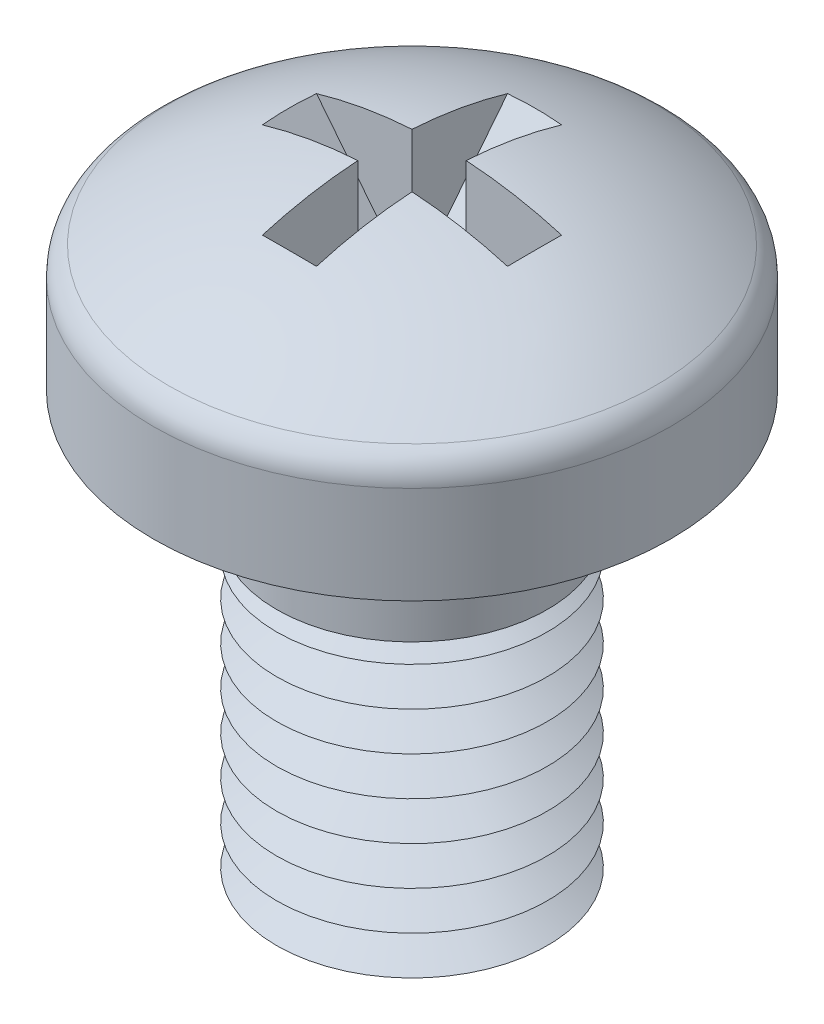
ISO-10303-21;
HEADER;
FILE_DESCRIPTION(('STEP AP214'),'2;1');
FILE_NAME('part.step','',(''),(''),'','','');
FILE_SCHEMA(('AUTOMOTIVE_DESIGN { 1 0 10303 214 1 1 1 1 }'));
ENDSEC;
DATA;
#1=APPLICATION_CONTEXT('core data for automotive mechanical design processes');
#2=APPLICATION_PROTOCOL_DEFINITION('international standard','automotive_design',2000,#1);
#3=PRODUCT_CONTEXT('',#1,'mechanical');
#4=PRODUCT('Part','Part','',(#3));
#5=PRODUCT_RELATED_PRODUCT_CATEGORY('part','',(#4));
#6=PRODUCT_DEFINITION_FORMATION('','',#4);
#7=PRODUCT_DEFINITION_CONTEXT('part definition',#1,'design');
#8=PRODUCT_DEFINITION('design','',#6,#7);
#9=PRODUCT_DEFINITION_SHAPE('','',#8);
#10=(LENGTH_UNIT() NAMED_UNIT(*) SI_UNIT(.MILLI.,.METRE.));
#11=(NAMED_UNIT(*) PLANE_ANGLE_UNIT() SI_UNIT($,.RADIAN.));
#12=(NAMED_UNIT(*) SI_UNIT($,.STERADIAN.) SOLID_ANGLE_UNIT());
#13=UNCERTAINTY_MEASURE_WITH_UNIT(LENGTH_MEASURE(1.E-05),#10,'distance_accuracy_value','');
#14=(GEOMETRIC_REPRESENTATION_CONTEXT(3) GLOBAL_UNCERTAINTY_ASSIGNED_CONTEXT((#13)) GLOBAL_UNIT_ASSIGNED_CONTEXT((#10,
#11,#12)) REPRESENTATION_CONTEXT('',''));
#15=CARTESIAN_POINT('',(0.,0.,0.));
#16=DIRECTION('',(0.,0.,1.));
#17=DIRECTION('',(1.,0.,0.));
#18=AXIS2_PLACEMENT_3D('',#15,#16,#17);
#19=CARTESIAN_POINT('',(2.535,3.7,-0.5));
#20=DIRECTION('',(0.783847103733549,-0.620953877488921,0.));
#21=DIRECTION('',(0.620953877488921,0.783847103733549,0.));
#22=AXIS2_PLACEMENT_3D('',#19,#20,#21);
#23=PLANE('',#22);
#24=DIRECTION('',(0.,0.,-1.));
#25=VECTOR('',#24,1.);
#26=CARTESIAN_POINT('',(0.5,1.13116370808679,-0.5));
#27=LINE('',#26,#25);
#28=CARTESIAN_POINT('',(0.5,1.13116370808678,0.5));
#29=VERTEX_POINT('',#28);
#30=CARTESIAN_POINT('',(0.5,1.13116370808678,-0.5));
#31=VERTEX_POINT('',#30);
#32=EDGE_CURVE('E137',#29,#31,#27,.T.);
#33=ORIENTED_EDGE('',*,*,#32,.F.);
#34=DIRECTION('',(0.620953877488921,0.783847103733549,0.));
#35=VECTOR('',#34,1.);
#36=CARTESIAN_POINT('',(2.535,3.7,0.5));
#37=LINE('',#36,#35);
#38=CARTESIAN_POINT('',(2.26395153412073,3.35784809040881,0.5));
#39=VERTEX_POINT('',#38);
#40=EDGE_CURVE('E178',#29,#39,#37,.T.);
#41=ORIENTED_EDGE('',*,*,#40,.T.);
#42=CARTESIAN_POINT('',(-2.34920201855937,-2.46546211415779,0.));
#43=DIRECTION('',(0.783847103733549,-0.620953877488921,0.));
#44=DIRECTION('',(0.620953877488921,0.783847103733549,0.));
#45=AXIS2_PLACEMENT_3D('',#42,#43,#44);
#46=CIRCLE('',#45,7.44594704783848);
#47=CARTESIAN_POINT('',(2.26395153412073,3.35784809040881,-0.5));
#48=VERTEX_POINT('',#47);
#49=EDGE_CURVE('E265',#39,#48,#46,.F.);
#50=ORIENTED_EDGE('',*,*,#49,.T.);
#51=DIRECTION('',(0.620953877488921,0.783847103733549,0.));
#52=VECTOR('',#51,1.);
#53=CARTESIAN_POINT('',(2.535,3.7,-0.5));
#54=LINE('',#53,#52);
#55=EDGE_CURVE('E184',#31,#48,#54,.T.);
#56=ORIENTED_EDGE('',*,*,#55,.F.);
#57=EDGE_LOOP('',(#33,#41,#50,#56));
#58=FACE_BOUND('',#57,.T.);
#59=ADVANCED_FACE('F31',(#58),#23,.F.);
#60=CARTESIAN_POINT('',(-2.535,5.55,-0.5));
#61=DIRECTION('',(0.,0.,-1.));
#62=DIRECTION('',(-1.,0.,0.));
#63=AXIS2_PLACEMENT_3D('',#60,#61,#62);
#64=PLANE('',#63);
#65=DIRECTION('',(0.620953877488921,-0.783847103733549,0.));
#66=VECTOR('',#65,1.);
#67=CARTESIAN_POINT('',(0.,0.5,-0.5));
#68=LINE('',#67,#66);
#69=CARTESIAN_POINT('',(-2.26395153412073,3.35784809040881,-0.5));
#70=VERTEX_POINT('',#69);
#71=CARTESIAN_POINT('',(-0.5,1.13116370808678,-0.5));
#72=VERTEX_POINT('',#71);
#73=EDGE_CURVE('E182',#70,#72,#68,.T.);
#74=ORIENTED_EDGE('',*,*,#73,.T.);
#75=DIRECTION('',(0.,1.,0.));
#76=VECTOR('',#75,1.);
#77=CARTESIAN_POINT('',(-0.5,5.55,-0.5));
#78=LINE('',#77,#76);
#79=CARTESIAN_POINT('',(-0.5,3.66879239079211,-0.5));
#80=VERTEX_POINT('',#79);
#81=EDGE_CURVE('E158',#72,#80,#78,.T.);
#82=ORIENTED_EDGE('',*,*,#81,.T.);
#83=CARTESIAN_POINT('',(0.,-4.32647058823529,-0.5));
#84=DIRECTION('',(0.,0.,-1.));
#85=DIRECTION('',(-1.,0.,0.));
#86=AXIS2_PLACEMENT_3D('',#83,#84,#85);
#87=CIRCLE('',#86,8.01088198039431);
#88=EDGE_CURVE('E268',#80,#70,#87,.F.);
#89=ORIENTED_EDGE('',*,*,#88,.T.);
#90=EDGE_LOOP('',(#74,#82,#89));
#91=FACE_BOUND('',#90,.T.);
#92=ADVANCED_FACE('F296',(#91),#64,.F.);
#93=DIRECTION('',(0.,1.,0.));
#94=VECTOR('',#93,1.);
#95=CARTESIAN_POINT('',(0.5,5.55,-0.5));
#96=LINE('',#95,#94);
#97=CARTESIAN_POINT('',(0.5,3.66879239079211,-0.5));
#98=VERTEX_POINT('',#97);
#99=EDGE_CURVE('E150',#31,#98,#96,.T.);
#100=ORIENTED_EDGE('',*,*,#99,.F.);
#101=ORIENTED_EDGE('',*,*,#55,.T.);
#102=EDGE_CURVE('E269',#48,#98,#87,.F.);
#103=ORIENTED_EDGE('',*,*,#102,.T.);
#104=EDGE_LOOP('',(#100,#101,#103));
#105=FACE_BOUND('',#104,.T.);
#106=ADVANCED_FACE('F324',(#105),#64,.F.);
#107=CARTESIAN_POINT('',(-2.535,5.55,0.5));
#108=DIRECTION('',(0.,0.,-1.));
#109=DIRECTION('',(-1.,0.,0.));
#110=AXIS2_PLACEMENT_3D('',#107,#108,#109);
#111=PLANE('',#110);
#112=DIRECTION('',(0.,1.,0.));
#113=VECTOR('',#112,1.);
#114=CARTESIAN_POINT('',(-0.5,5.55,0.5));
#115=LINE('',#114,#113);
#116=CARTESIAN_POINT('',(-0.5,1.13116370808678,0.5));
#117=VERTEX_POINT('',#116);
#118=CARTESIAN_POINT('',(-0.5,3.66879239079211,0.5));
#119=VERTEX_POINT('',#118);
#120=EDGE_CURVE('E39',#117,#119,#115,.T.);
#121=ORIENTED_EDGE('',*,*,#120,.F.);
#122=DIRECTION('',(0.620953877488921,-0.783847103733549,0.));
#123=VECTOR('',#122,1.);
#124=CARTESIAN_POINT('',(0.,0.5,0.5));
#125=LINE('',#124,#123);
#126=CARTESIAN_POINT('',(-2.26395153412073,3.35784809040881,0.5));
#127=VERTEX_POINT('',#126);
#128=EDGE_CURVE('E175',#127,#117,#125,.T.);
#129=ORIENTED_EDGE('',*,*,#128,.F.);
#130=CARTESIAN_POINT('',(0.,-4.32647058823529,0.5));
#131=DIRECTION('',(0.,0.,-1.));
#132=DIRECTION('',(-1.,0.,0.));
#133=AXIS2_PLACEMENT_3D('',#130,#131,#132);
#134=CIRCLE('',#133,8.01088198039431);
#135=EDGE_CURVE('E196',#119,#127,#134,.F.);
#136=ORIENTED_EDGE('',*,*,#135,.F.);
#137=EDGE_LOOP('',(#121,#129,#136));
#138=FACE_BOUND('',#137,.T.);
#139=ADVANCED_FACE('F288',(#138),#111,.T.);
#140=ORIENTED_EDGE('',*,*,#40,.F.);
#141=DIRECTION('',(0.,1.,0.));
#142=VECTOR('',#141,1.);
#143=CARTESIAN_POINT('',(0.5,5.55,0.5));
#144=LINE('',#143,#142);
#145=CARTESIAN_POINT('',(0.5,3.66879239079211,0.5));
#146=VERTEX_POINT('',#145);
#147=EDGE_CURVE('E272',#29,#146,#144,.T.);
#148=ORIENTED_EDGE('',*,*,#147,.T.);
#149=EDGE_CURVE('E259',#39,#146,#134,.F.);
#150=ORIENTED_EDGE('',*,*,#149,.F.);
#151=EDGE_LOOP('',(#140,#148,#150));
#152=FACE_BOUND('',#151,.T.);
#153=ADVANCED_FACE('F329',(#152),#111,.T.);
#154=CARTESIAN_POINT('',(0.,0.,0.));
#155=DIRECTION('',(0.,-1.,0.));
#156=DIRECTION('',(0.,0.,-1.));
#157=AXIS2_PLACEMENT_3D('',#154,#155,#156);
#158=PLANE('',#157);
#159=CARTESIAN_POINT('',(0.,0.,0.));
#160=DIRECTION('',(0.,-1.,0.));
#161=DIRECTION('',(0.,0.,-1.));
#162=AXIS2_PLACEMENT_3D('',#159,#160,#161);
#163=CIRCLE('',#162,2.5);
#164=CARTESIAN_POINT('',(0.,0.,-2.5));
#165=VERTEX_POINT('',#164);
#166=EDGE_CURVE('E193',#165,#165,#163,.T.);
#167=ORIENTED_EDGE('',*,*,#166,.F.);
#168=EDGE_LOOP('',(#167));
#169=FACE_BOUND('',#168,.T.);
#170=CARTESIAN_POINT('',(0.,0.,0.));
#171=DIRECTION('',(0.,-1.,0.));
#172=DIRECTION('',(0.,0.,-1.));
#173=AXIS2_PLACEMENT_3D('',#170,#171,#172);
#174=CIRCLE('',#173,4.77647058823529);
#175=CARTESIAN_POINT('',(0.,0.,-4.77647058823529));
#176=VERTEX_POINT('',#175);
#177=EDGE_CURVE('E197',#176,#176,#174,.T.);
#178=ORIENTED_EDGE('',*,*,#177,.T.);
#179=EDGE_LOOP('',(#178));
#180=FACE_BOUND('',#179,.T.);
#181=ADVANCED_FACE('F33',(#169,#180),#158,.T.);
#182=CARTESIAN_POINT('',(0.,0.,0.));
#183=DIRECTION('',(0.,-1.,0.));
#184=DIRECTION('',(0.,0.,-1.));
#185=AXIS2_PLACEMENT_3D('',#182,#183,#184);
#186=CYLINDRICAL_SURFACE('',#185,4.77647058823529);
#187=CARTESIAN_POINT('',(0.,1.80031486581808,0.));
#188=DIRECTION('',(0.,-1.,0.));
#189=DIRECTION('',(0.,0.,-1.));
#190=AXIS2_PLACEMENT_3D('',#187,#188,#189);
#191=CIRCLE('',#190,4.77647058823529);
#192=CARTESIAN_POINT('',(0.,1.80031486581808,-4.77647058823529));
#193=VERTEX_POINT('',#192);
#194=EDGE_CURVE('E254',#193,#193,#191,.T.);
#195=ORIENTED_EDGE('',*,*,#194,.T.);
#196=EDGE_LOOP('',(#195));
#197=FACE_BOUND('',#196,.T.);
#198=ORIENTED_EDGE('',*,*,#177,.F.);
#199=EDGE_LOOP('',(#198));
#200=FACE_BOUND('',#199,.T.);
#201=ADVANCED_FACE('F468',(#197,#200),#186,.T.);
#202=CARTESIAN_POINT('',(0.,1.80031486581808,0.));
#203=DIRECTION('',(0.,-1.,0.));
#204=DIRECTION('',(0.,0.,-1.));
#205=AXIS2_PLACEMENT_3D('',#202,#203,#204);
#206=TOROIDAL_SURFACE('',#205,4.15,0.626470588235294);
#207=CARTESIAN_POINT('',(0.,2.31899741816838,0.));
#208=DIRECTION('',(0.,-1.,0.));
#209=DIRECTION('',(0.,0.,-1.));
#210=AXIS2_PLACEMENT_3D('',#207,#208,#209);
#211=CIRCLE('',#210,4.50133147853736);
#212=CARTESIAN_POINT('',(0.,2.31899741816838,-4.50133147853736));
#213=VERTEX_POINT('',#212);
#214=EDGE_CURVE('E251',#213,#213,#211,.T.);
#215=ORIENTED_EDGE('',*,*,#214,.T.);
#216=EDGE_LOOP('',(#215));
#217=FACE_BOUND('',#216,.T.);
#218=ORIENTED_EDGE('',*,*,#194,.F.);
#219=EDGE_LOOP('',(#218));
#220=FACE_BOUND('',#219,.T.);
#221=ADVANCED_FACE('F466',(#217,#220),#206,.T.);
#222=CARTESIAN_POINT('',(0.,-4.32647058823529,0.));
#223=DIRECTION('',(0.,0.,1.));
#224=DIRECTION('',(1.,0.,0.));
#225=AXIS2_PLACEMENT_3D('',#222,#223,#224);
#226=SPHERICAL_SURFACE('',#225,8.02647058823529);
#227=CARTESIAN_POINT('',(-0.5,-4.32647058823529,0.));
#228=DIRECTION('',(-1.,0.,0.));
#229=DIRECTION('',(0.,0.,1.));
#230=AXIS2_PLACEMENT_3D('',#227,#228,#229);
#231=CIRCLE('',#230,8.01088198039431);
#232=CARTESIAN_POINT('',(-0.5,3.35784809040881,-2.26395153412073));
#233=VERTEX_POINT('',#232);
#234=EDGE_CURVE('E159',#233,#80,#231,.F.);
#235=ORIENTED_EDGE('',*,*,#234,.F.);
#236=CARTESIAN_POINT('',(0.,-2.46546211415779,2.34920201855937));
#237=DIRECTION('',(0.,-0.620953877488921,-0.783847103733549));
#238=DIRECTION('',(0.,0.783847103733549,-0.620953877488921));
#239=AXIS2_PLACEMENT_3D('',#236,#237,#238);
#240=CIRCLE('',#239,7.44594704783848);
#241=CARTESIAN_POINT('',(0.5,3.35784809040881,-2.26395153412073));
#242=VERTEX_POINT('',#241);
#243=EDGE_CURVE('E172',#242,#233,#240,.F.);
#244=ORIENTED_EDGE('',*,*,#243,.F.);
#245=CARTESIAN_POINT('',(0.5,-4.32647058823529,0.));
#246=DIRECTION('',(-1.,0.,0.));
#247=DIRECTION('',(0.,0.,1.));
#248=AXIS2_PLACEMENT_3D('',#245,#246,#247);
#249=CIRCLE('',#248,8.01088198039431);
#250=EDGE_CURVE('E151',#242,#98,#249,.F.);
#251=ORIENTED_EDGE('',*,*,#250,.T.);
#252=ORIENTED_EDGE('',*,*,#102,.F.);
#253=ORIENTED_EDGE('',*,*,#49,.F.);
#254=ORIENTED_EDGE('',*,*,#149,.T.);
#255=CARTESIAN_POINT('',(0.5,3.35784809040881,2.26395153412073));
#256=VERTEX_POINT('',#255);
#257=EDGE_CURVE('E147',#146,#256,#249,.F.);
#258=ORIENTED_EDGE('',*,*,#257,.T.);
#259=CARTESIAN_POINT('',(0.,-2.46546211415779,-2.34920201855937));
#260=DIRECTION('',(0.,-0.620953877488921,0.783847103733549));
#261=DIRECTION('',(0.,-0.783847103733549,-0.620953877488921));
#262=AXIS2_PLACEMENT_3D('',#259,#260,#261);
#263=CIRCLE('',#262,7.44594704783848);
#264=CARTESIAN_POINT('',(-0.5,3.35784809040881,2.26395153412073));
#265=VERTEX_POINT('',#264);
#266=EDGE_CURVE('E166',#265,#256,#263,.F.);
#267=ORIENTED_EDGE('',*,*,#266,.F.);
#268=EDGE_CURVE('E156',#119,#265,#231,.F.);
#269=ORIENTED_EDGE('',*,*,#268,.F.);
#270=ORIENTED_EDGE('',*,*,#135,.T.);
#271=CARTESIAN_POINT('',(2.34920201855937,-2.46546211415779,0.));
#272=DIRECTION('',(-0.783847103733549,-0.620953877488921,0.));
#273=DIRECTION('',(0.620953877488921,-0.783847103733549,0.));
#274=AXIS2_PLACEMENT_3D('',#271,#272,#273);
#275=CIRCLE('',#274,7.44594704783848);
#276=EDGE_CURVE('E262',#70,#127,#275,.F.);
#277=ORIENTED_EDGE('',*,*,#276,.F.);
#278=ORIENTED_EDGE('',*,*,#88,.F.);
#279=EDGE_LOOP('',(#235,#244,#251,#252,#253,#254,#258,#267,#269,#270,#277,#278));
#280=FACE_BOUND('',#279,.T.);
#281=ORIENTED_EDGE('',*,*,#214,.F.);
#282=EDGE_LOOP('',(#281));
#283=FACE_BOUND('',#282,.T.);
#284=ADVANCED_FACE('F285',(#280,#283),#226,.T.);
#285=CARTESIAN_POINT('',(0.,-8.,0.));
#286=DIRECTION('',(0.,-1.,0.));
#287=DIRECTION('',(0.,0.,-1.));
#288=AXIS2_PLACEMENT_3D('',#285,#286,#287);
#289=PLANE('',#288);
#290=CARTESIAN_POINT('',(0.,-8.,0.));
#291=DIRECTION('',(0.,-1.,0.));
#292=DIRECTION('',(0.,0.,-1.));
#293=AXIS2_PLACEMENT_3D('',#290,#291,#292);
#294=CIRCLE('',#293,1.879225);
#295=CARTESIAN_POINT('',(0.,-8.,-1.879225));
#296=VERTEX_POINT('',#295);
#297=EDGE_CURVE('E248',#296,#296,#294,.T.);
#298=ORIENTED_EDGE('',*,*,#297,.T.);
#299=EDGE_LOOP('',(#298));
#300=FACE_BOUND('',#299,.T.);
#301=ADVANCED_FACE('F459',(#300),#289,.T.);
#302=CARTESIAN_POINT('',(0.,-8.,0.));
#303=DIRECTION('',(0.,1.,0.));
#304=DIRECTION('',(0.,0.,1.));
#305=AXIS2_PLACEMENT_3D('',#302,#303,#304);
#306=CONICAL_SURFACE('',#305,1.879225,1.0471975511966);
#307=CARTESIAN_POINT('',(0.,-7.64159538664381,0.));
#308=DIRECTION('',(0.,-1.,0.));
#309=DIRECTION('',(0.,0.,-1.));
#310=AXIS2_PLACEMENT_3D('',#307,#308,#309);
#311=CIRCLE('',#310,2.5);
#312=CARTESIAN_POINT('',(0.,-7.64159538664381,-2.5));
#313=VERTEX_POINT('',#312);
#314=EDGE_CURVE('E245',#313,#313,#311,.T.);
#315=ORIENTED_EDGE('',*,*,#314,.T.);
#316=EDGE_LOOP('',(#315));
#317=FACE_BOUND('',#316,.T.);
#318=ORIENTED_EDGE('',*,*,#297,.F.);
#319=EDGE_LOOP('',(#318));
#320=FACE_BOUND('',#319,.T.);
#321=ADVANCED_FACE('F455',(#317,#320),#306,.T.);
#322=CARTESIAN_POINT('',(0.,-7.64159538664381,0.));
#323=DIRECTION('',(0.,-1.,0.));
#324=DIRECTION('',(0.,0.,-1.));
#325=AXIS2_PLACEMENT_3D('',#322,#323,#324);
#326=CONICAL_SURFACE('',#325,2.5,1.0471975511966);
#327=CARTESIAN_POINT('',(0.,-7.28319077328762,0.));
#328=DIRECTION('',(0.,-1.,0.));
#329=DIRECTION('',(0.,0.,-1.));
#330=AXIS2_PLACEMENT_3D('',#327,#328,#329);
#331=CIRCLE('',#330,1.879225);
#332=CARTESIAN_POINT('',(0.,-7.28319077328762,-1.879225));
#333=VERTEX_POINT('',#332);
#334=EDGE_CURVE('E242',#333,#333,#331,.T.);
#335=ORIENTED_EDGE('',*,*,#334,.T.);
#336=EDGE_LOOP('',(#335));
#337=FACE_BOUND('',#336,.T.);
#338=ORIENTED_EDGE('',*,*,#314,.F.);
#339=EDGE_LOOP('',(#338));
#340=FACE_BOUND('',#339,.T.);
#341=ADVANCED_FACE('F451',(#337,#340),#326,.T.);
#342=CARTESIAN_POINT('',(0.,-7.28319077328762,0.));
#343=DIRECTION('',(0.,1.,0.));
#344=DIRECTION('',(0.,0.,1.));
#345=AXIS2_PLACEMENT_3D('',#342,#343,#344);
#346=CONICAL_SURFACE('',#345,1.879225,1.0471975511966);
#347=CARTESIAN_POINT('',(0.,-6.92478615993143,0.));
#348=DIRECTION('',(0.,-1.,0.));
#349=DIRECTION('',(0.,0.,-1.));
#350=AXIS2_PLACEMENT_3D('',#347,#348,#349);
#351=CIRCLE('',#350,2.5);
#352=CARTESIAN_POINT('',(0.,-6.92478615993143,-2.5));
#353=VERTEX_POINT('',#352);
#354=EDGE_CURVE('E239',#353,#353,#351,.T.);
#355=ORIENTED_EDGE('',*,*,#354,.T.);
#356=EDGE_LOOP('',(#355));
#357=FACE_BOUND('',#356,.T.);
#358=ORIENTED_EDGE('',*,*,#334,.F.);
#359=EDGE_LOOP('',(#358));
#360=FACE_BOUND('',#359,.T.);
#361=ADVANCED_FACE('F447',(#357,#360),#346,.T.);
#362=CARTESIAN_POINT('',(0.,-6.92478615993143,0.));
#363=DIRECTION('',(0.,-1.,0.));
#364=DIRECTION('',(0.,0.,-1.));
#365=AXIS2_PLACEMENT_3D('',#362,#363,#364);
#366=CONICAL_SURFACE('',#365,2.5,1.0471975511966);
#367=CARTESIAN_POINT('',(0.,-6.56638154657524,0.));
#368=DIRECTION('',(0.,-1.,0.));
#369=DIRECTION('',(0.,0.,-1.));
#370=AXIS2_PLACEMENT_3D('',#367,#368,#369);
#371=CIRCLE('',#370,1.879225);
#372=CARTESIAN_POINT('',(0.,-6.56638154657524,-1.879225));
#373=VERTEX_POINT('',#372);
#374=EDGE_CURVE('E236',#373,#373,#371,.T.);
#375=ORIENTED_EDGE('',*,*,#374,.T.);
#376=EDGE_LOOP('',(#375));
#377=FACE_BOUND('',#376,.T.);
#378=ORIENTED_EDGE('',*,*,#354,.F.);
#379=EDGE_LOOP('',(#378));
#380=FACE_BOUND('',#379,.T.);
#381=ADVANCED_FACE('F443',(#377,#380),#366,.T.);
#382=CARTESIAN_POINT('',(0.,-6.56638154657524,0.));
#383=DIRECTION('',(0.,1.,0.));
#384=DIRECTION('',(0.,0.,1.));
#385=AXIS2_PLACEMENT_3D('',#382,#383,#384);
#386=CONICAL_SURFACE('',#385,1.879225,1.0471975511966);
#387=CARTESIAN_POINT('',(0.,-6.20797693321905,0.));
#388=DIRECTION('',(0.,-1.,0.));
#389=DIRECTION('',(0.,0.,-1.));
#390=AXIS2_PLACEMENT_3D('',#387,#388,#389);
#391=CIRCLE('',#390,2.5);
#392=CARTESIAN_POINT('',(0.,-6.20797693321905,-2.5));
#393=VERTEX_POINT('',#392);
#394=EDGE_CURVE('E233',#393,#393,#391,.T.);
#395=ORIENTED_EDGE('',*,*,#394,.T.);
#396=EDGE_LOOP('',(#395));
#397=FACE_BOUND('',#396,.T.);
#398=ORIENTED_EDGE('',*,*,#374,.F.);
#399=EDGE_LOOP('',(#398));
#400=FACE_BOUND('',#399,.T.);
#401=ADVANCED_FACE('F439',(#397,#400),#386,.T.);
#402=CARTESIAN_POINT('',(0.,-6.20797693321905,0.));
#403=DIRECTION('',(0.,-1.,0.));
#404=DIRECTION('',(0.,0.,-1.));
#405=AXIS2_PLACEMENT_3D('',#402,#403,#404);
#406=CONICAL_SURFACE('',#405,2.5,1.0471975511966);
#407=CARTESIAN_POINT('',(0.,-5.84957231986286,0.));
#408=DIRECTION('',(0.,-1.,0.));
#409=DIRECTION('',(0.,0.,-1.));
#410=AXIS2_PLACEMENT_3D('',#407,#408,#409);
#411=CIRCLE('',#410,1.879225);
#412=CARTESIAN_POINT('',(0.,-5.84957231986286,-1.879225));
#413=VERTEX_POINT('',#412);
#414=EDGE_CURVE('E230',#413,#413,#411,.T.);
#415=ORIENTED_EDGE('',*,*,#414,.T.);
#416=EDGE_LOOP('',(#415));
#417=FACE_BOUND('',#416,.T.);
#418=ORIENTED_EDGE('',*,*,#394,.F.);
#419=EDGE_LOOP('',(#418));
#420=FACE_BOUND('',#419,.T.);
#421=ADVANCED_FACE('F435',(#417,#420),#406,.T.);
#422=CARTESIAN_POINT('',(0.,-5.84957231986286,0.));
#423=DIRECTION('',(0.,1.,0.));
#424=DIRECTION('',(0.,0.,1.));
#425=AXIS2_PLACEMENT_3D('',#422,#423,#424);
#426=CONICAL_SURFACE('',#425,1.879225,1.0471975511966);
#427=CARTESIAN_POINT('',(0.,-5.49116770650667,0.));
#428=DIRECTION('',(0.,-1.,0.));
#429=DIRECTION('',(0.,0.,-1.));
#430=AXIS2_PLACEMENT_3D('',#427,#428,#429);
#431=CIRCLE('',#430,2.5);
#432=CARTESIAN_POINT('',(0.,-5.49116770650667,-2.5));
#433=VERTEX_POINT('',#432);
#434=EDGE_CURVE('E227',#433,#433,#431,.T.);
#435=ORIENTED_EDGE('',*,*,#434,.T.);
#436=EDGE_LOOP('',(#435));
#437=FACE_BOUND('',#436,.T.);
#438=ORIENTED_EDGE('',*,*,#414,.F.);
#439=EDGE_LOOP('',(#438));
#440=FACE_BOUND('',#439,.T.);
#441=ADVANCED_FACE('F431',(#437,#440),#426,.T.);
#442=CARTESIAN_POINT('',(0.,-5.49116770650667,0.));
#443=DIRECTION('',(0.,-1.,0.));
#444=DIRECTION('',(0.,0.,-1.));
#445=AXIS2_PLACEMENT_3D('',#442,#443,#444);
#446=CONICAL_SURFACE('',#445,2.5,1.0471975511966);
#447=CARTESIAN_POINT('',(0.,-5.13276309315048,0.));
#448=DIRECTION('',(0.,-1.,0.));
#449=DIRECTION('',(0.,0.,-1.));
#450=AXIS2_PLACEMENT_3D('',#447,#448,#449);
#451=CIRCLE('',#450,1.879225);
#452=CARTESIAN_POINT('',(0.,-5.13276309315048,-1.879225));
#453=VERTEX_POINT('',#452);
#454=EDGE_CURVE('E224',#453,#453,#451,.T.);
#455=ORIENTED_EDGE('',*,*,#454,.T.);
#456=EDGE_LOOP('',(#455));
#457=FACE_BOUND('',#456,.T.);
#458=ORIENTED_EDGE('',*,*,#434,.F.);
#459=EDGE_LOOP('',(#458));
#460=FACE_BOUND('',#459,.T.);
#461=ADVANCED_FACE('F427',(#457,#460),#446,.T.);
#462=CARTESIAN_POINT('',(0.,-5.13276309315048,0.));
#463=DIRECTION('',(0.,1.,0.));
#464=DIRECTION('',(0.,0.,1.));
#465=AXIS2_PLACEMENT_3D('',#462,#463,#464);
#466=CONICAL_SURFACE('',#465,1.879225,1.0471975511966);
#467=CARTESIAN_POINT('',(0.,-4.77435847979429,0.));
#468=DIRECTION('',(0.,-1.,0.));
#469=DIRECTION('',(0.,0.,-1.));
#470=AXIS2_PLACEMENT_3D('',#467,#468,#469);
#471=CIRCLE('',#470,2.5);
#472=CARTESIAN_POINT('',(0.,-4.77435847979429,-2.5));
#473=VERTEX_POINT('',#472);
#474=EDGE_CURVE('E221',#473,#473,#471,.T.);
#475=ORIENTED_EDGE('',*,*,#474,.T.);
#476=EDGE_LOOP('',(#475));
#477=FACE_BOUND('',#476,.T.);
#478=ORIENTED_EDGE('',*,*,#454,.F.);
#479=EDGE_LOOP('',(#478));
#480=FACE_BOUND('',#479,.T.);
#481=ADVANCED_FACE('F423',(#477,#480),#466,.T.);
#482=CARTESIAN_POINT('',(0.,-4.77435847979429,0.));
#483=DIRECTION('',(0.,-1.,0.));
#484=DIRECTION('',(0.,0.,-1.));
#485=AXIS2_PLACEMENT_3D('',#482,#483,#484);
#486=CONICAL_SURFACE('',#485,2.5,1.0471975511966);
#487=CARTESIAN_POINT('',(0.,-4.4159538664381,0.));
#488=DIRECTION('',(0.,-1.,0.));
#489=DIRECTION('',(0.,0.,-1.));
#490=AXIS2_PLACEMENT_3D('',#487,#488,#489);
#491=CIRCLE('',#490,1.879225);
#492=CARTESIAN_POINT('',(0.,-4.4159538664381,-1.879225));
#493=VERTEX_POINT('',#492);
#494=EDGE_CURVE('E218',#493,#493,#491,.T.);
#495=ORIENTED_EDGE('',*,*,#494,.T.);
#496=EDGE_LOOP('',(#495));
#497=FACE_BOUND('',#496,.T.);
#498=ORIENTED_EDGE('',*,*,#474,.F.);
#499=EDGE_LOOP('',(#498));
#500=FACE_BOUND('',#499,.T.);
#501=ADVANCED_FACE('F419',(#497,#500),#486,.T.);
#502=CARTESIAN_POINT('',(0.,-4.4159538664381,0.));
#503=DIRECTION('',(0.,1.,0.));
#504=DIRECTION('',(0.,0.,1.));
#505=AXIS2_PLACEMENT_3D('',#502,#503,#504);
#506=CONICAL_SURFACE('',#505,1.879225,1.0471975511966);
#507=CARTESIAN_POINT('',(0.,-4.05754925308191,0.));
#508=DIRECTION('',(0.,-1.,0.));
#509=DIRECTION('',(0.,0.,-1.));
#510=AXIS2_PLACEMENT_3D('',#507,#508,#509);
#511=CIRCLE('',#510,2.5);
#512=CARTESIAN_POINT('',(0.,-4.05754925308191,-2.5));
#513=VERTEX_POINT('',#512);
#514=EDGE_CURVE('E215',#513,#513,#511,.T.);
#515=ORIENTED_EDGE('',*,*,#514,.T.);
#516=EDGE_LOOP('',(#515));
#517=FACE_BOUND('',#516,.T.);
#518=ORIENTED_EDGE('',*,*,#494,.F.);
#519=EDGE_LOOP('',(#518));
#520=FACE_BOUND('',#519,.T.);
#521=ADVANCED_FACE('F415',(#517,#520),#506,.T.);
#522=CARTESIAN_POINT('',(0.,-4.05754925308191,0.));
#523=DIRECTION('',(0.,-1.,0.));
#524=DIRECTION('',(0.,0.,-1.));
#525=AXIS2_PLACEMENT_3D('',#522,#523,#524);
#526=CONICAL_SURFACE('',#525,2.5,1.0471975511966);
#527=CARTESIAN_POINT('',(0.,-3.69914463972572,0.));
#528=DIRECTION('',(0.,-1.,0.));
#529=DIRECTION('',(0.,0.,-1.));
#530=AXIS2_PLACEMENT_3D('',#527,#528,#529);
#531=CIRCLE('',#530,1.879225);
#532=CARTESIAN_POINT('',(0.,-3.69914463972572,-1.879225));
#533=VERTEX_POINT('',#532);
#534=EDGE_CURVE('E212',#533,#533,#531,.T.);
#535=ORIENTED_EDGE('',*,*,#534,.T.);
#536=EDGE_LOOP('',(#535));
#537=FACE_BOUND('',#536,.T.);
#538=ORIENTED_EDGE('',*,*,#514,.F.);
#539=EDGE_LOOP('',(#538));
#540=FACE_BOUND('',#539,.T.);
#541=ADVANCED_FACE('F411',(#537,#540),#526,.T.);
#542=CARTESIAN_POINT('',(0.,-3.69914463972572,0.));
#543=DIRECTION('',(0.,1.,0.));
#544=DIRECTION('',(0.,0.,1.));
#545=AXIS2_PLACEMENT_3D('',#542,#543,#544);
#546=CONICAL_SURFACE('',#545,1.879225,1.0471975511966);
#547=CARTESIAN_POINT('',(0.,-3.34074002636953,0.));
#548=DIRECTION('',(0.,-1.,0.));
#549=DIRECTION('',(0.,0.,-1.));
#550=AXIS2_PLACEMENT_3D('',#547,#548,#549);
#551=CIRCLE('',#550,2.5);
#552=CARTESIAN_POINT('',(0.,-3.34074002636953,-2.5));
#553=VERTEX_POINT('',#552);
#554=EDGE_CURVE('E209',#553,#553,#551,.T.);
#555=ORIENTED_EDGE('',*,*,#554,.T.);
#556=EDGE_LOOP('',(#555));
#557=FACE_BOUND('',#556,.T.);
#558=ORIENTED_EDGE('',*,*,#534,.F.);
#559=EDGE_LOOP('',(#558));
#560=FACE_BOUND('',#559,.T.);
#561=ADVANCED_FACE('F407',(#557,#560),#546,.T.);
#562=CARTESIAN_POINT('',(0.,-3.34074002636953,0.));
#563=DIRECTION('',(0.,-1.,0.));
#564=DIRECTION('',(0.,0.,-1.));
#565=AXIS2_PLACEMENT_3D('',#562,#563,#564);
#566=CONICAL_SURFACE('',#565,2.5,1.0471975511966);
#567=CARTESIAN_POINT('',(0.,-2.98233541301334,0.));
#568=DIRECTION('',(0.,-1.,0.));
#569=DIRECTION('',(0.,0.,-1.));
#570=AXIS2_PLACEMENT_3D('',#567,#568,#569);
#571=CIRCLE('',#570,1.879225);
#572=CARTESIAN_POINT('',(0.,-2.98233541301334,-1.879225));
#573=VERTEX_POINT('',#572);
#574=EDGE_CURVE('E206',#573,#573,#571,.T.);
#575=ORIENTED_EDGE('',*,*,#574,.T.);
#576=EDGE_LOOP('',(#575));
#577=FACE_BOUND('',#576,.T.);
#578=ORIENTED_EDGE('',*,*,#554,.F.);
#579=EDGE_LOOP('',(#578));
#580=FACE_BOUND('',#579,.T.);
#581=ADVANCED_FACE('F403',(#577,#580),#566,.T.);
#582=CARTESIAN_POINT('',(0.,-2.98233541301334,0.));
#583=DIRECTION('',(0.,1.,0.));
#584=DIRECTION('',(0.,0.,1.));
#585=AXIS2_PLACEMENT_3D('',#582,#583,#584);
#586=CONICAL_SURFACE('',#585,1.879225,1.0471975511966);
#587=CARTESIAN_POINT('',(0.,-2.62393079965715,0.));
#588=DIRECTION('',(0.,-1.,0.));
#589=DIRECTION('',(0.,0.,-1.));
#590=AXIS2_PLACEMENT_3D('',#587,#588,#589);
#591=CIRCLE('',#590,2.5);
#592=CARTESIAN_POINT('',(0.,-2.62393079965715,-2.5));
#593=VERTEX_POINT('',#592);
#594=EDGE_CURVE('E203',#593,#593,#591,.T.);
#595=ORIENTED_EDGE('',*,*,#594,.T.);
#596=EDGE_LOOP('',(#595));
#597=FACE_BOUND('',#596,.T.);
#598=ORIENTED_EDGE('',*,*,#574,.F.);
#599=EDGE_LOOP('',(#598));
#600=FACE_BOUND('',#599,.T.);
#601=ADVANCED_FACE('F399',(#597,#600),#586,.T.);
#602=CARTESIAN_POINT('',(0.,-2.62393079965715,0.));
#603=DIRECTION('',(0.,-1.,0.));
#604=DIRECTION('',(0.,0.,-1.));
#605=AXIS2_PLACEMENT_3D('',#602,#603,#604);
#606=CONICAL_SURFACE('',#605,2.5,1.0471975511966);
#607=CARTESIAN_POINT('',(0.,-2.26552618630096,0.));
#608=DIRECTION('',(0.,-1.,0.));
#609=DIRECTION('',(0.,0.,-1.));
#610=AXIS2_PLACEMENT_3D('',#607,#608,#609);
#611=CIRCLE('',#610,1.879225);
#612=CARTESIAN_POINT('',(0.,-2.26552618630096,-1.879225));
#613=VERTEX_POINT('',#612);
#614=EDGE_CURVE('E200',#613,#613,#611,.T.);
#615=ORIENTED_EDGE('',*,*,#614,.T.);
#616=EDGE_LOOP('',(#615));
#617=FACE_BOUND('',#616,.T.);
#618=ORIENTED_EDGE('',*,*,#594,.F.);
#619=EDGE_LOOP('',(#618));
#620=FACE_BOUND('',#619,.T.);
#621=ADVANCED_FACE('F392',(#617,#620),#606,.T.);
#622=CARTESIAN_POINT('',(1.879225,-2.26552618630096,0.));
#623=DIRECTION('',(0.,-1.,0.));
#624=DIRECTION('',(0.,0.,-1.));
#625=AXIS2_PLACEMENT_3D('',#622,#623,#624);
#626=PLANE('',#625);
#627=CARTESIAN_POINT('',(0.,-2.26552618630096,0.));
#628=DIRECTION('',(0.,-1.,0.));
#629=DIRECTION('',(0.,0.,-1.));
#630=AXIS2_PLACEMENT_3D('',#627,#628,#629);
#631=CIRCLE('',#630,2.5);
#632=CARTESIAN_POINT('',(0.,-2.26552618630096,-2.5));
#633=VERTEX_POINT('',#632);
#634=EDGE_CURVE('E192',#633,#633,#631,.T.);
#635=ORIENTED_EDGE('',*,*,#634,.T.);
#636=EDGE_LOOP('',(#635));
#637=FACE_BOUND('',#636,.T.);
#638=ORIENTED_EDGE('',*,*,#614,.F.);
#639=EDGE_LOOP('',(#638));
#640=FACE_BOUND('',#639,.T.);
#641=ADVANCED_FACE('F387',(#637,#640),#626,.T.);
#642=CARTESIAN_POINT('',(0.,0.,0.));
#643=DIRECTION('',(0.,-1.,0.));
#644=DIRECTION('',(0.,0.,-1.));
#645=AXIS2_PLACEMENT_3D('',#642,#643,#644);
#646=CYLINDRICAL_SURFACE('',#645,2.5);
#647=ORIENTED_EDGE('',*,*,#166,.T.);
#648=EDGE_LOOP('',(#647));
#649=FACE_BOUND('',#648,.T.);
#650=ORIENTED_EDGE('',*,*,#634,.F.);
#651=EDGE_LOOP('',(#650));
#652=FACE_BOUND('',#651,.T.);
#653=ADVANCED_FACE('F380',(#649,#652),#646,.T.);
#654=CARTESIAN_POINT('',(0.,0.5,-0.5));
#655=DIRECTION('',(-0.783847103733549,-0.620953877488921,0.));
#656=DIRECTION('',(0.620953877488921,-0.783847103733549,0.));
#657=AXIS2_PLACEMENT_3D('',#654,#655,#656);
#658=PLANE('',#657);
#659=ORIENTED_EDGE('',*,*,#128,.T.);
#660=DIRECTION('',(0.,0.,-1.));
#661=VECTOR('',#660,1.);
#662=CARTESIAN_POINT('',(-0.5,1.13116370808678,-0.5));
#663=LINE('',#662,#661);
#664=EDGE_CURVE('E153',#117,#72,#663,.T.);
#665=ORIENTED_EDGE('',*,*,#664,.T.);
#666=ORIENTED_EDGE('',*,*,#73,.F.);
#667=ORIENTED_EDGE('',*,*,#276,.T.);
#668=EDGE_LOOP('',(#659,#665,#666,#667));
#669=FACE_BOUND('',#668,.T.);
#670=ADVANCED_FACE('F292',(#669),#658,.F.);
#671=CARTESIAN_POINT('',(0.5,5.55,2.535));
#672=DIRECTION('',(-1.,0.,0.));
#673=DIRECTION('',(0.,0.,1.));
#674=AXIS2_PLACEMENT_3D('',#671,#672,#673);
#675=PLANE('',#674);
#676=ORIENTED_EDGE('',*,*,#147,.F.);
#677=DIRECTION('',(0.,-0.783847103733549,-0.620953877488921));
#678=VECTOR('',#677,1.);
#679=CARTESIAN_POINT('',(0.5,0.5,0.));
#680=LINE('',#679,#678);
#681=EDGE_CURVE('E133',#256,#29,#680,.T.);
#682=ORIENTED_EDGE('',*,*,#681,.F.);
#683=ORIENTED_EDGE('',*,*,#257,.F.);
#684=EDGE_LOOP('',(#676,#682,#683));
#685=FACE_BOUND('',#684,.T.);
#686=ADVANCED_FACE('F333',(#685),#675,.T.);
#687=CARTESIAN_POINT('',(-0.5,5.55,2.535));
#688=DIRECTION('',(-1.,0.,0.));
#689=DIRECTION('',(0.,0.,1.));
#690=AXIS2_PLACEMENT_3D('',#687,#688,#689);
#691=PLANE('',#690);
#692=ORIENTED_EDGE('',*,*,#268,.T.);
#693=DIRECTION('',(0.,-0.783847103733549,-0.620953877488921));
#694=VECTOR('',#693,1.);
#695=CARTESIAN_POINT('',(-0.5,0.5,0.));
#696=LINE('',#695,#694);
#697=EDGE_CURVE('E54',#265,#117,#696,.T.);
#698=ORIENTED_EDGE('',*,*,#697,.T.);
#699=ORIENTED_EDGE('',*,*,#120,.T.);
#700=EDGE_LOOP('',(#692,#698,#699));
#701=FACE_BOUND('',#700,.T.);
#702=ADVANCED_FACE('F278',(#701),#691,.F.);
#703=CARTESIAN_POINT('',(-0.5,0.5,0.));
#704=DIRECTION('',(0.,-0.620953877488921,0.783847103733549));
#705=DIRECTION('',(0.,-0.783847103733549,-0.620953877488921));
#706=AXIS2_PLACEMENT_3D('',#703,#704,#705);
#707=PLANE('',#706);
#708=ORIENTED_EDGE('',*,*,#266,.T.);
#709=ORIENTED_EDGE('',*,*,#681,.T.);
#710=DIRECTION('',(-1.,0.,0.));
#711=VECTOR('',#710,1.);
#712=CARTESIAN_POINT('',(-2.535,1.13116370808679,0.5));
#713=LINE('',#712,#711);
#714=EDGE_CURVE('E275',#29,#117,#713,.T.);
#715=ORIENTED_EDGE('',*,*,#714,.T.);
#716=ORIENTED_EDGE('',*,*,#697,.F.);
#717=EDGE_LOOP('',(#708,#709,#715,#716));
#718=FACE_BOUND('',#717,.T.);
#719=ADVANCED_FACE('F336',(#718),#707,.F.);
#720=ORIENTED_EDGE('',*,*,#714,.F.);
#721=CARTESIAN_POINT('',(0.,0.5,0.5));
#722=VERTEX_POINT('',#721);
#723=EDGE_CURVE('E179',#722,#29,#37,.T.);
#724=ORIENTED_EDGE('',*,*,#723,.F.);
#725=EDGE_CURVE('E174',#117,#722,#125,.T.);
#726=ORIENTED_EDGE('',*,*,#725,.F.);
#727=EDGE_LOOP('',(#720,#724,#726));
#728=FACE_BOUND('',#727,.T.);
#729=ADVANCED_FACE('F340',(#728),#111,.T.);
#730=DIRECTION('',(0.,0.,1.));
#731=VECTOR('',#730,1.);
#732=CARTESIAN_POINT('',(0.,0.5,-0.5));
#733=LINE('',#732,#731);
#734=CARTESIAN_POINT('',(0.,0.5,0.));
#735=VERTEX_POINT('',#734);
#736=EDGE_CURVE('E188',#735,#722,#733,.T.);
#737=ORIENTED_EDGE('',*,*,#736,.F.);
#738=DIRECTION('',(-0.527524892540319,0.66590913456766,0.527524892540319));
#739=VECTOR('',#738,1.);
#740=CARTESIAN_POINT('',(0.139141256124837,0.324358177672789,-0.139141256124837));
#741=LINE('',#740,#739);
#742=EDGE_CURVE('E162',#735,#117,#741,.T.);
#743=ORIENTED_EDGE('',*,*,#742,.T.);
#744=ORIENTED_EDGE('',*,*,#725,.T.);
#745=EDGE_LOOP('',(#737,#743,#744));
#746=FACE_BOUND('',#745,.T.);
#747=ADVANCED_FACE('F344',(#746),#658,.F.);
#748=ORIENTED_EDGE('',*,*,#723,.T.);
#749=DIRECTION('',(-0.527524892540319,-0.66590913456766,-0.527524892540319));
#750=VECTOR('',#749,1.);
#751=CARTESIAN_POINT('',(1.69041257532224,2.63385413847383,1.69041257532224));
#752=LINE('',#751,#750);
#753=EDGE_CURVE('E129',#29,#735,#752,.T.);
#754=ORIENTED_EDGE('',*,*,#753,.T.);
#755=ORIENTED_EDGE('',*,*,#736,.T.);
#756=EDGE_LOOP('',(#748,#754,#755));
#757=FACE_BOUND('',#756,.T.);
#758=ADVANCED_FACE('F361',(#757),#23,.F.);
#759=ORIENTED_EDGE('',*,*,#234,.T.);
#760=ORIENTED_EDGE('',*,*,#81,.F.);
#761=DIRECTION('',(0.,0.783847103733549,-0.620953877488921));
#762=VECTOR('',#761,1.);
#763=CARTESIAN_POINT('',(-0.5,3.7,-2.535));
#764=LINE('',#763,#762);
#765=EDGE_CURVE('E143',#72,#233,#764,.T.);
#766=ORIENTED_EDGE('',*,*,#765,.T.);
#767=EDGE_LOOP('',(#759,#760,#766));
#768=FACE_BOUND('',#767,.T.);
#769=ADVANCED_FACE('F301',(#768),#691,.F.);
#770=DIRECTION('',(0.,0.783847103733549,-0.620953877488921));
#771=VECTOR('',#770,1.);
#772=CARTESIAN_POINT('',(0.5,3.7,-2.535));
#773=LINE('',#772,#771);
#774=EDGE_CURVE('E46',#31,#242,#773,.T.);
#775=ORIENTED_EDGE('',*,*,#774,.F.);
#776=ORIENTED_EDGE('',*,*,#99,.T.);
#777=ORIENTED_EDGE('',*,*,#250,.F.);
#778=EDGE_LOOP('',(#775,#776,#777));
#779=FACE_BOUND('',#778,.T.);
#780=ADVANCED_FACE('F386',(#779),#675,.T.);
#781=CARTESIAN_POINT('',(-0.5,3.7,-2.535));
#782=DIRECTION('',(0.,-0.620953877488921,-0.783847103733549));
#783=DIRECTION('',(0.,0.783847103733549,-0.620953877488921));
#784=AXIS2_PLACEMENT_3D('',#781,#782,#783);
#785=PLANE('',#784);
#786=ORIENTED_EDGE('',*,*,#243,.T.);
#787=ORIENTED_EDGE('',*,*,#765,.F.);
#788=DIRECTION('',(-1.,0.,0.));
#789=VECTOR('',#788,1.);
#790=CARTESIAN_POINT('',(-2.535,1.13116370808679,-0.5));
#791=LINE('',#790,#789);
#792=EDGE_CURVE('E11',#31,#72,#791,.T.);
#793=ORIENTED_EDGE('',*,*,#792,.F.);
#794=ORIENTED_EDGE('',*,*,#774,.T.);
#795=EDGE_LOOP('',(#786,#787,#793,#794));
#796=FACE_BOUND('',#795,.T.);
#797=ADVANCED_FACE('F319',(#796),#785,.F.);
#798=CARTESIAN_POINT('',(0.,0.5,-0.5));
#799=VERTEX_POINT('',#798);
#800=EDGE_CURVE('E185',#799,#31,#54,.T.);
#801=ORIENTED_EDGE('',*,*,#800,.T.);
#802=ORIENTED_EDGE('',*,*,#792,.T.);
#803=EDGE_CURVE('E181',#72,#799,#68,.T.);
#804=ORIENTED_EDGE('',*,*,#803,.T.);
#805=EDGE_LOOP('',(#801,#802,#804));
#806=FACE_BOUND('',#805,.T.);
#807=ADVANCED_FACE('F317',(#806),#64,.F.);
#808=ORIENTED_EDGE('',*,*,#803,.F.);
#809=DIRECTION('',(0.527524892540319,-0.66590913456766,0.527524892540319));
#810=VECTOR('',#809,1.);
#811=CARTESIAN_POINT('',(-0.139141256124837,0.675641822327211,-0.139141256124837));
#812=LINE('',#811,#810);
#813=EDGE_CURVE('E168',#72,#735,#812,.T.);
#814=ORIENTED_EDGE('',*,*,#813,.T.);
#815=EDGE_CURVE('E189',#799,#735,#733,.T.);
#816=ORIENTED_EDGE('',*,*,#815,.F.);
#817=EDGE_LOOP('',(#808,#814,#816));
#818=FACE_BOUND('',#817,.T.);
#819=ADVANCED_FACE('F314',(#818),#658,.F.);
#820=ORIENTED_EDGE('',*,*,#815,.T.);
#821=DIRECTION('',(0.527524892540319,0.66590913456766,-0.527524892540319));
#822=VECTOR('',#821,1.);
#823=CARTESIAN_POINT('',(1.96869508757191,2.98513778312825,-1.96869508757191));
#824=LINE('',#823,#822);
#825=EDGE_CURVE('E118',#735,#31,#824,.T.);
#826=ORIENTED_EDGE('',*,*,#825,.T.);
#827=ORIENTED_EDGE('',*,*,#800,.F.);
#828=EDGE_LOOP('',(#820,#826,#827));
#829=FACE_BOUND('',#828,.T.);
#830=ADVANCED_FACE('F354',(#829),#23,.F.);
#831=CARTESIAN_POINT('',(-0.5,0.5,0.));
#832=VERTEX_POINT('',#831);
#833=EDGE_CURVE('E138',#117,#832,#696,.T.);
#834=ORIENTED_EDGE('',*,*,#833,.T.);
#835=EDGE_CURVE('E123',#832,#72,#764,.T.);
#836=ORIENTED_EDGE('',*,*,#835,.T.);
#837=ORIENTED_EDGE('',*,*,#664,.F.);
#838=EDGE_LOOP('',(#834,#836,#837));
#839=FACE_BOUND('',#838,.T.);
#840=ADVANCED_FACE('F312',(#839),#691,.F.);
#841=DIRECTION('',(1.,0.,0.));
#842=VECTOR('',#841,1.);
#843=CARTESIAN_POINT('',(-0.5,0.5,0.));
#844=LINE('',#843,#842);
#845=EDGE_CURVE('E122',#832,#735,#844,.T.);
#846=ORIENTED_EDGE('',*,*,#845,.F.);
#847=ORIENTED_EDGE('',*,*,#833,.F.);
#848=ORIENTED_EDGE('',*,*,#742,.F.);
#849=EDGE_LOOP('',(#846,#847,#848));
#850=FACE_BOUND('',#849,.T.);
#851=ADVANCED_FACE('F346',(#850),#707,.F.);
#852=ORIENTED_EDGE('',*,*,#835,.F.);
#853=ORIENTED_EDGE('',*,*,#845,.T.);
#854=ORIENTED_EDGE('',*,*,#813,.F.);
#855=EDGE_LOOP('',(#852,#853,#854));
#856=FACE_BOUND('',#855,.T.);
#857=ADVANCED_FACE('F305',(#856),#785,.F.);
#858=CARTESIAN_POINT('',(0.5,0.5,0.));
#859=VERTEX_POINT('',#858);
#860=EDGE_CURVE('E111',#735,#859,#844,.T.);
#861=ORIENTED_EDGE('',*,*,#860,.T.);
#862=EDGE_CURVE('E115',#859,#31,#773,.T.);
#863=ORIENTED_EDGE('',*,*,#862,.T.);
#864=ORIENTED_EDGE('',*,*,#825,.F.);
#865=EDGE_LOOP('',(#861,#863,#864));
#866=FACE_BOUND('',#865,.T.);
#867=ADVANCED_FACE('F113',(#866),#785,.F.);
#868=EDGE_CURVE('E126',#29,#859,#680,.T.);
#869=ORIENTED_EDGE('',*,*,#868,.T.);
#870=ORIENTED_EDGE('',*,*,#860,.F.);
#871=ORIENTED_EDGE('',*,*,#753,.F.);
#872=EDGE_LOOP('',(#869,#870,#871));
#873=FACE_BOUND('',#872,.T.);
#874=ADVANCED_FACE('F127',(#873),#707,.F.);
#875=ORIENTED_EDGE('',*,*,#32,.T.);
#876=ORIENTED_EDGE('',*,*,#862,.F.);
#877=ORIENTED_EDGE('',*,*,#868,.F.);
#878=EDGE_LOOP('',(#875,#876,#877));
#879=FACE_BOUND('',#878,.T.);
#880=ADVANCED_FACE('F135',(#879),#675,.T.);
#881=CLOSED_SHELL('',(#59,#92,#106,#139,#153,#181,#201,#221,#284,#301,#321,#341,#361,#381,#401,
#421,#441,#461,#481,#501,#521,#541,#561,#581,#601,#621,#641,#653,#670,#686,#702,#719,#729,#747,
#758,#769,#780,#797,#807,#819,#830,#840,#851,#857,#867,#874,#880));
#882=MANIFOLD_SOLID_BREP('B2',#881);
#883=ADVANCED_BREP_SHAPE_REPRESENTATION('',(#18,#882),#14);
#884=SHAPE_DEFINITION_REPRESENTATION(#9,#883);
ENDSEC;
END-ISO-10303-21;
